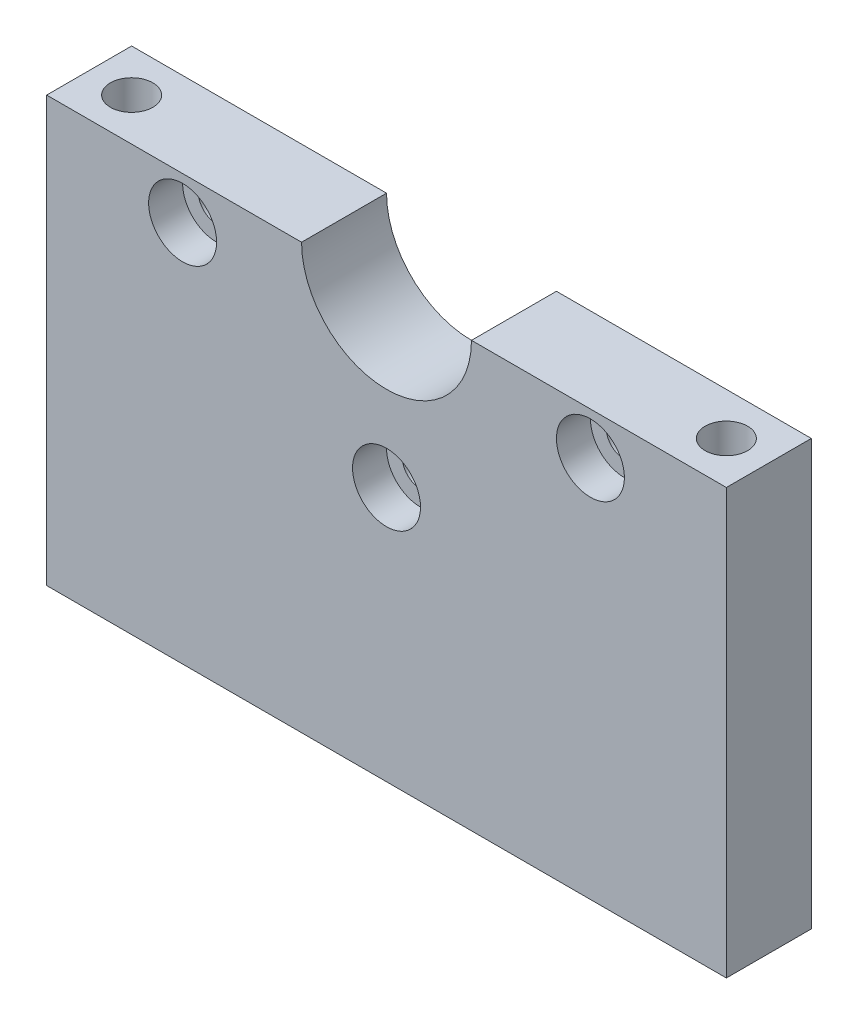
from build123d import *

# Parameters (mm, degrees)
SKETCH1_W                      = 80
SKETCH1_H                      = 50
BOSS_EXTRUDE1_DEPTH            = 5
CUT_EXTRUDE1_REACH             = 50.218
SKETCH2_R                      = 10
CBORE_FOR_M4_SHCS1_D           = 4.3
CBORE_FOR_M4_SHCS1_CBORE_D     = 8
CBORE_FOR_M4_SHCS1_CBORE_DEPTH = 4
M4X0_7_TAPPED_HOLE1_D          = 3.3
M4X0_7_TAPPED_HOLE1_DEPTH      = 10
M4X0_7_TAPPED_HOLE1_TIP        = 0.991420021
M6X1_0_TAPPED_HOLE1_D          = 5
M6X1_0_TAPPED_HOLE1_DEPTH      = 15
M6X1_0_TAPPED_HOLE1_TIP        = 1.502151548


with BuildPart() as part:
    # Sketch1 → Boss-Extrude1 (new, symmetric)
    with BuildSketch(Plane.XY):
        Rectangle(SKETCH1_W, SKETCH1_H)
    extrude(amount=BOSS_EXTRUDE1_DEPTH, both=True)

    # Sketch2 → Cut-Extrude1 (cut, up to next)
    with BuildSketch(Plane.XY.offset(5), mode=Mode.PRIVATE) as cut_extrude1_sk1:
        with Locations((0, 25)):
            Circle(SKETCH2_R)
    cut_extrude1_tool1 = extrude(cut_extrude1_sk1.sketch, amount=-CUT_EXTRUDE1_REACH, mode=Mode.PRIVATE) & part.part
    add(cut_extrude1_tool1.solids().sort_by_distance((0, 25, 5))[0], mode=Mode.SUBTRACT)

    # CBORE for M4 SHCS1 (through all)
    with Locations(Plane(origin=(0, -13.621175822, 5), x_dir=(1, 0, 0), z_dir=(0, 0, 1))):
        with Locations((-24, 33.621175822), (0, 18.621175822), (24, 33.621175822)):
            CounterBoreHole(CBORE_FOR_M4_SHCS1_D / 2, CBORE_FOR_M4_SHCS1_CBORE_D / 2, CBORE_FOR_M4_SHCS1_CBORE_DEPTH)

    # M4x0.7 Tapped Hole1
    with Locations(Plane(origin=(0, -25, 0), x_dir=(-1, 0, 0), z_dir=(0, -1, 0))):
        with Locations((25, 0), (-25, 0)):
            Hole(M4X0_7_TAPPED_HOLE1_D / 2, depth=M4X0_7_TAPPED_HOLE1_DEPTH)
            with Locations((0, 0, -(M4X0_7_TAPPED_HOLE1_DEPTH + M4X0_7_TAPPED_HOLE1_TIP / 2))):  # 118° drill point
                Cone(0, M4X0_7_TAPPED_HOLE1_D / 2, M4X0_7_TAPPED_HOLE1_TIP, mode=Mode.SUBTRACT)

    # M6x1.0 Tapped Hole1
    with Locations(Plane(origin=(0, 25, 0), x_dir=(1, 0, 0), z_dir=(0, 1, 0))):
        with Locations((-35, 0), (35, 0)):
            Hole(M6X1_0_TAPPED_HOLE1_D / 2, depth=M6X1_0_TAPPED_HOLE1_DEPTH)
            with Locations((0, 0, -(M6X1_0_TAPPED_HOLE1_DEPTH + M6X1_0_TAPPED_HOLE1_TIP / 2))):  # 118° drill point
                Cone(0, M6X1_0_TAPPED_HOLE1_D / 2, M6X1_0_TAPPED_HOLE1_TIP, mode=Mode.SUBTRACT)


solid = part.part
